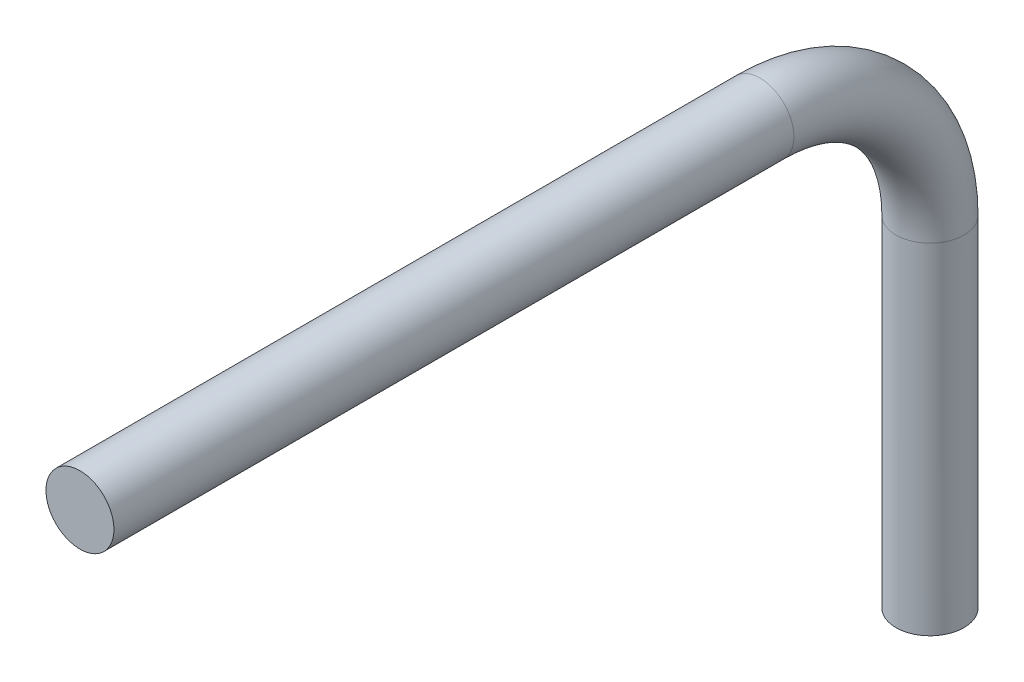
from build123d import *

# Parameters (mm, degrees)
SKETCH2_R = 5


with BuildPart() as part:
    # Sweep1: sweep along a path in Sketch1
    with BuildLine(Plane(origin=(0, 0, 0), x_dir=(0, 0, -1), z_dir=(1, 0, 0))) as sweep1_path:
        Line((0, 0), (100, 0))
        ThreePointArc((100, 0), (117.67766953, -7.32233047), (125, -25))
        Line((125, -25), (125, -75))
    # Sketch2 → Sweep1 (sweep)
    with BuildSketch(Plane.XY):
        Circle(SKETCH2_R)
    sweep(path=sweep1_path.line)


solid = part.part
